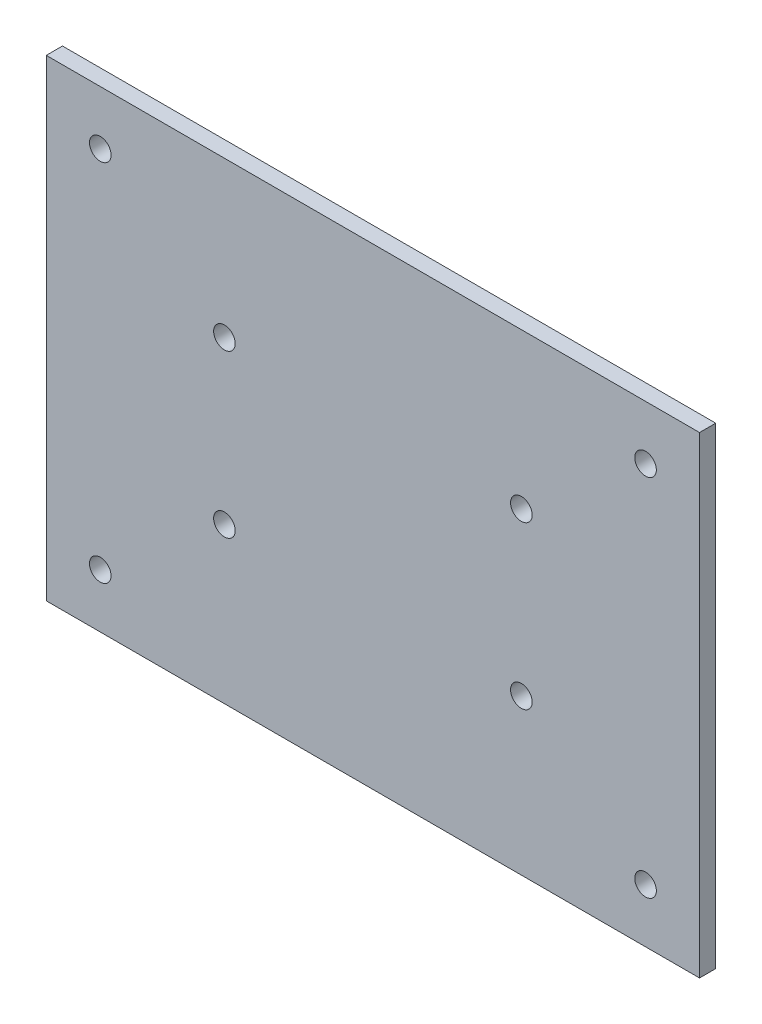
from build123d import *

# Parameters (mm, degrees)
SKETCH_1_W            = 121
SKETCH_1_H            = 87.5
EXTRUDE_1_DEPTH       = 3
HOLE_WIZARD_4_0_4_1_D = 4
HOLE_WIZARD_4_0_4_2_D = 4


with BuildPart() as part:
    # Sketch 1 → Extrude 1 (new body)
    with BuildSketch(Plane.XY):
        Rectangle(SKETCH_1_W, SKETCH_1_H)
    extrude(amount=EXTRUDE_1_DEPTH)

    # Hole Wizard 4.0 _4_ _1 (through all)
    with Locations(Plane.XY.offset(3)):
        with Locations((-27.5, 15), (-27.5, -15), (27.5, 15), (27.5, -15)):
            Hole(HOLE_WIZARD_4_0_4_1_D / 2)

    # Hole Wizard 4.0 _4_ _2 (through all)
    with Locations(Plane.XY.offset(3)):
        with Locations((-50.5, 33.75), (-50.5, -33.75), (50.5, 33.75), (50.5, -33.75)):
            Hole(HOLE_WIZARD_4_0_4_2_D / 2)


solid = part.part
